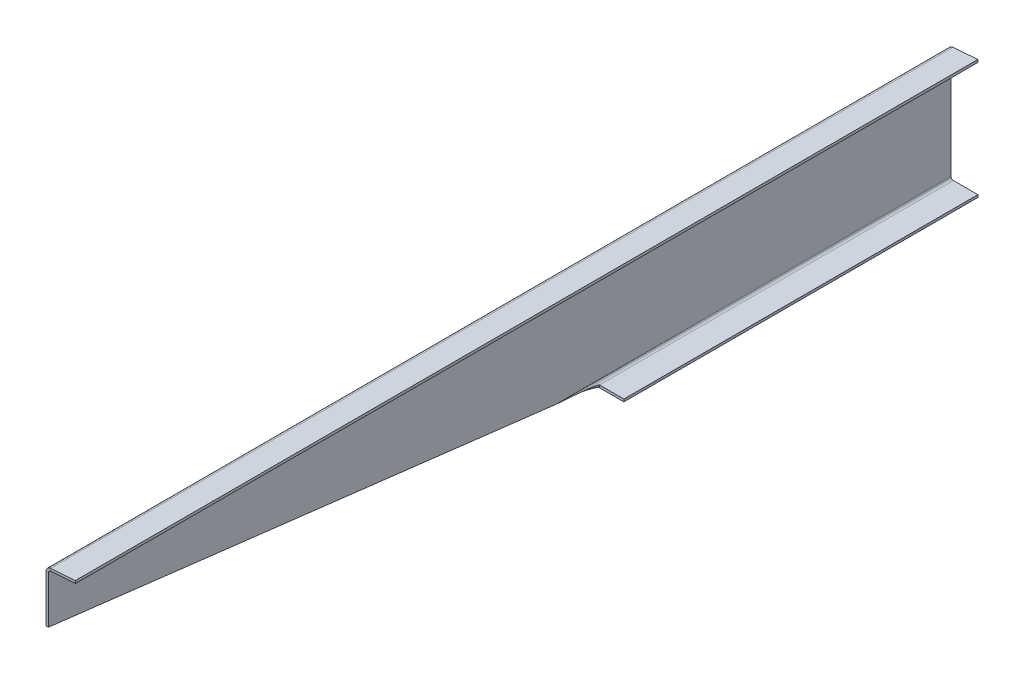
ISO-10303-21;
HEADER;
FILE_DESCRIPTION(('STEP AP214'),'2;1');
FILE_NAME('part.step','',(''),(''),'','','');
FILE_SCHEMA(('AUTOMOTIVE_DESIGN { 1 0 10303 214 1 1 1 1 }'));
ENDSEC;
DATA;
#1=APPLICATION_CONTEXT('core data for automotive mechanical design processes');
#2=APPLICATION_PROTOCOL_DEFINITION('international standard','automotive_design',2000,#1);
#3=PRODUCT_CONTEXT('',#1,'mechanical');
#4=PRODUCT('Part','Part','',(#3));
#5=PRODUCT_RELATED_PRODUCT_CATEGORY('part','',(#4));
#6=PRODUCT_DEFINITION_FORMATION('','',#4);
#7=PRODUCT_DEFINITION_CONTEXT('part definition',#1,'design');
#8=PRODUCT_DEFINITION('design','',#6,#7);
#9=PRODUCT_DEFINITION_SHAPE('','',#8);
#10=(LENGTH_UNIT() NAMED_UNIT(*) SI_UNIT(.MILLI.,.METRE.));
#11=(NAMED_UNIT(*) PLANE_ANGLE_UNIT() SI_UNIT($,.RADIAN.));
#12=(NAMED_UNIT(*) SI_UNIT($,.STERADIAN.) SOLID_ANGLE_UNIT());
#13=UNCERTAINTY_MEASURE_WITH_UNIT(LENGTH_MEASURE(1.E-05),#10,'distance_accuracy_value','');
#14=(GEOMETRIC_REPRESENTATION_CONTEXT(3) GLOBAL_UNCERTAINTY_ASSIGNED_CONTEXT((#13)) GLOBAL_UNIT_ASSIGNED_CONTEXT((#10,
#11,#12)) REPRESENTATION_CONTEXT('',''));
#15=CARTESIAN_POINT('',(0.,0.,0.));
#16=DIRECTION('',(0.,0.,1.));
#17=DIRECTION('',(1.,0.,0.));
#18=AXIS2_PLACEMENT_3D('',#15,#16,#17);
#19=CARTESIAN_POINT('',(12.7000000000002,6.35000000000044,2343.15));
#20=DIRECTION('',(0.,0.,1.));
#21=DIRECTION('',(1.,0.,0.));
#22=AXIS2_PLACEMENT_3D('',#19,#20,#21);
#23=PLANE('',#22);
#24=DIRECTION('',(0.,1.,0.));
#25=VECTOR('',#24,1.);
#26=CARTESIAN_POINT('',(0.,0.,2343.15));
#27=LINE('',#26,#25);
#28=CARTESIAN_POINT('',(0.,170.415443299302,2343.15));
#29=VERTEX_POINT('',#28);
#30=CARTESIAN_POINT('',(0.,292.957058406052,2343.15));
#31=VERTEX_POINT('',#30);
#32=EDGE_CURVE('E128',#29,#31,#27,.T.);
#33=ORIENTED_EDGE('',*,*,#32,.F.);
#34=DIRECTION('',(-1.,0.,0.));
#35=VECTOR('',#34,1.);
#36=CARTESIAN_POINT('',(0.,170.415443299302,2343.15));
#37=LINE('',#36,#35);
#38=CARTESIAN_POINT('',(6.35,170.415443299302,2343.15));
#39=VERTEX_POINT('',#38);
#40=EDGE_CURVE('E366',#29,#39,#37,.F.);
#41=ORIENTED_EDGE('',*,*,#40,.T.);
#42=DIRECTION('',(0.,1.,0.));
#43=VECTOR('',#42,1.);
#44=CARTESIAN_POINT('',(6.35,0.,2343.15));
#45=LINE('',#44,#43);
#46=CARTESIAN_POINT('',(6.35,292.957058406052,2343.15));
#47=VERTEX_POINT('',#46);
#48=EDGE_CURVE('E139',#39,#47,#45,.T.);
#49=ORIENTED_EDGE('',*,*,#48,.T.);
#50=DIRECTION('',(-1.,0.,0.));
#51=VECTOR('',#50,1.);
#52=CARTESIAN_POINT('',(6.35,292.957058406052,2343.15));
#53=LINE('',#52,#51);
#54=EDGE_CURVE('E48',#47,#31,#53,.T.);
#55=ORIENTED_EDGE('',*,*,#54,.T.);
#56=EDGE_LOOP('',(#33,#41,#49,#55));
#57=FACE_BOUND('',#56,.T.);
#58=ADVANCED_FACE('F40',(#57),#23,.T.);
#59=CARTESIAN_POINT('',(0.,0.,2343.15));
#60=DIRECTION('',(-1.,0.,0.));
#61=DIRECTION('',(0.,0.,1.));
#62=AXIS2_PLACEMENT_3D('',#59,#60,#61);
#63=PLANE('',#62);
#64=DIRECTION('',(0.,0.,-1.));
#65=VECTOR('',#64,1.);
#66=CARTESIAN_POINT('',(0.,12.7000000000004,2343.15));
#67=LINE('',#66,#65);
#68=CARTESIAN_POINT('',(0.,12.7000000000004,1025.20433517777));
#69=VERTEX_POINT('',#68);
#70=CARTESIAN_POINT('',(0.,12.7000000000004,0.));
#71=VERTEX_POINT('',#70);
#72=EDGE_CURVE('E155',#69,#71,#67,.T.);
#73=ORIENTED_EDGE('',*,*,#72,.F.);
#74=DIRECTION('',(0.,0.118819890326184,0.992915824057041));
#75=VECTOR('',#74,1.);
#76=CARTESIAN_POINT('',(0.,170.415443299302,2343.15));
#77=LINE('',#76,#75);
#78=EDGE_CURVE('E136',#69,#29,#77,.T.);
#79=ORIENTED_EDGE('',*,*,#78,.T.);
#80=ORIENTED_EDGE('',*,*,#32,.T.);
#81=DIRECTION('',(0.,0.,-1.));
#82=VECTOR('',#81,1.);
#83=CARTESIAN_POINT('',(0.,292.957058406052,2343.15));
#84=LINE('',#83,#82);
#85=CARTESIAN_POINT('',(0.,292.957058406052,0.));
#86=VERTEX_POINT('',#85);
#87=EDGE_CURVE('E134',#31,#86,#84,.T.);
#88=ORIENTED_EDGE('',*,*,#87,.T.);
#89=DIRECTION('',(0.,1.,0.));
#90=VECTOR('',#89,1.);
#91=CARTESIAN_POINT('',(0.,0.,0.));
#92=LINE('',#91,#90);
#93=EDGE_CURVE('E179',#71,#86,#92,.T.);
#94=ORIENTED_EDGE('',*,*,#93,.F.);
#95=EDGE_LOOP('',(#73,#79,#80,#88,#94));
#96=FACE_BOUND('',#95,.T.);
#97=ADVANCED_FACE('F131',(#96),#63,.T.);
#98=CARTESIAN_POINT('',(12.7,12.7000000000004,2343.15));
#99=DIRECTION('',(0.,0.,-1.));
#100=DIRECTION('',(-1.,0.,0.));
#101=AXIS2_PLACEMENT_3D('',#98,#99,#100);
#102=CYLINDRICAL_SURFACE('',#101,12.7);
#103=DIRECTION('',(0.,0.,-1.));
#104=VECTOR('',#103,1.);
#105=CARTESIAN_POINT('',(12.7000000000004,4.44089209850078E-13,2343.15));
#106=LINE('',#105,#104);
#107=CARTESIAN_POINT('',(12.7000000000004,2.72004641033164E-12,919.077061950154));
#108=VERTEX_POINT('',#107);
#109=CARTESIAN_POINT('',(12.7000000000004,4.44089209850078E-13,0.));
#110=VERTEX_POINT('',#109);
#111=EDGE_CURVE('E214',#108,#110,#106,.T.);
#112=ORIENTED_EDGE('',*,*,#111,.F.);
#113=CARTESIAN_POINT('',(12.7,12.7000000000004,1025.20433517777));
#114=DIRECTION('',(0.,0.992915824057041,-0.118819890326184));
#115=DIRECTION('',(0.,-0.118819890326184,-0.992915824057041));
#116=AXIS2_PLACEMENT_3D('',#113,#114,#115);
#117=ELLIPSE('',#116,106.884461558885,12.7);
#118=EDGE_CURVE('E330',#69,#108,#117,.F.);
#119=ORIENTED_EDGE('',*,*,#118,.F.);
#120=ORIENTED_EDGE('',*,*,#72,.T.);
#121=CARTESIAN_POINT('',(12.7,12.7000000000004,0.));
#122=DIRECTION('',(0.,0.,-1.));
#123=DIRECTION('',(-1.,0.,0.));
#124=AXIS2_PLACEMENT_3D('',#121,#122,#123);
#125=CIRCLE('',#124,12.7);
#126=EDGE_CURVE('E181',#110,#71,#125,.T.);
#127=ORIENTED_EDGE('',*,*,#126,.F.);
#128=EDGE_LOOP('',(#112,#119,#120,#127));
#129=FACE_BOUND('',#128,.T.);
#130=ADVANCED_FACE('F256',(#129),#102,.T.);
#131=CARTESIAN_POINT('',(76.2,2.66453525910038E-12,2343.15));
#132=DIRECTION('',(0.,-1.,0.));
#133=DIRECTION('',(1.,0.,0.));
#134=AXIS2_PLACEMENT_3D('',#131,#132,#133);
#135=PLANE('',#134);
#136=DIRECTION('',(0.,0.,-1.));
#137=VECTOR('',#136,1.);
#138=CARTESIAN_POINT('',(76.2,2.66453525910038E-12,2343.15));
#139=LINE('',#138,#137);
#140=CARTESIAN_POINT('',(76.2,2.72004641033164E-12,919.077061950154));
#141=VERTEX_POINT('',#140);
#142=CARTESIAN_POINT('',(76.2,2.66453525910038E-12,0.));
#143=VERTEX_POINT('',#142);
#144=EDGE_CURVE('E212',#141,#143,#139,.T.);
#145=ORIENTED_EDGE('',*,*,#144,.F.);
#146=DIRECTION('',(1.,0.,0.));
#147=VECTOR('',#146,1.);
#148=CARTESIAN_POINT('',(0.,2.72004641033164E-12,919.077061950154));
#149=LINE('',#148,#147);
#150=EDGE_CURVE('E345',#108,#141,#149,.T.);
#151=ORIENTED_EDGE('',*,*,#150,.F.);
#152=ORIENTED_EDGE('',*,*,#111,.T.);
#153=DIRECTION('',(-1.,0.,0.));
#154=VECTOR('',#153,1.);
#155=CARTESIAN_POINT('',(76.2,2.66453525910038E-12,0.));
#156=LINE('',#155,#154);
#157=EDGE_CURVE('E184',#143,#110,#156,.T.);
#158=ORIENTED_EDGE('',*,*,#157,.F.);
#159=EDGE_LOOP('',(#145,#151,#152,#158));
#160=FACE_BOUND('',#159,.T.);
#161=ADVANCED_FACE('F282',(#160),#135,.T.);
#162=CARTESIAN_POINT('',(76.1999999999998,6.35000000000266,2343.15));
#163=DIRECTION('',(1.,0.,0.));
#164=DIRECTION('',(0.,1.,0.));
#165=AXIS2_PLACEMENT_3D('',#162,#163,#164);
#166=PLANE('',#165);
#167=DIRECTION('',(0.,0.,-1.));
#168=VECTOR('',#167,1.);
#169=CARTESIAN_POINT('',(76.1999999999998,6.35000000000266,2343.15));
#170=LINE('',#169,#168);
#171=CARTESIAN_POINT('',(76.1999999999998,6.35000000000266,919.077061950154));
#172=VERTEX_POINT('',#171);
#173=CARTESIAN_POINT('',(76.1999999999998,6.35000000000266,0.));
#174=VERTEX_POINT('',#173);
#175=EDGE_CURVE('E210',#172,#174,#170,.T.);
#176=ORIENTED_EDGE('',*,*,#175,.F.);
#177=DIRECTION('',(0.,-1.,0.));
#178=VECTOR('',#177,1.);
#179=CARTESIAN_POINT('',(76.2,2.72004641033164E-12,919.077061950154));
#180=LINE('',#179,#178);
#181=EDGE_CURVE('E349',#141,#172,#180,.F.);
#182=ORIENTED_EDGE('',*,*,#181,.F.);
#183=ORIENTED_EDGE('',*,*,#144,.T.);
#184=DIRECTION('',(0.,-1.,0.));
#185=VECTOR('',#184,1.);
#186=CARTESIAN_POINT('',(76.1999999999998,6.35000000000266,0.));
#187=LINE('',#186,#185);
#188=EDGE_CURVE('E187',#174,#143,#187,.T.);
#189=ORIENTED_EDGE('',*,*,#188,.F.);
#190=EDGE_LOOP('',(#176,#182,#183,#189));
#191=FACE_BOUND('',#190,.T.);
#192=ADVANCED_FACE('F286',(#191),#166,.T.);
#193=CARTESIAN_POINT('',(76.1999999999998,6.35000000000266,2343.15));
#194=DIRECTION('',(0.,-1.,0.));
#195=DIRECTION('',(1.,0.,0.));
#196=AXIS2_PLACEMENT_3D('',#193,#194,#195);
#197=PLANE('',#196);
#198=DIRECTION('',(1.,0.,0.));
#199=VECTOR('',#198,1.);
#200=CARTESIAN_POINT('',(76.1999999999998,6.35000000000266,919.077061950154));
#201=LINE('',#200,#199);
#202=CARTESIAN_POINT('',(12.7000000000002,6.35000000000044,919.077061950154));
#203=VERTEX_POINT('',#202);
#204=EDGE_CURVE('E348',#203,#172,#201,.T.);
#205=ORIENTED_EDGE('',*,*,#204,.T.);
#206=ORIENTED_EDGE('',*,*,#175,.T.);
#207=DIRECTION('',(-1.,0.,0.));
#208=VECTOR('',#207,1.);
#209=CARTESIAN_POINT('',(76.1999999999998,6.35000000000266,0.));
#210=LINE('',#209,#208);
#211=CARTESIAN_POINT('',(12.7000000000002,6.35000000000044,0.));
#212=VERTEX_POINT('',#211);
#213=EDGE_CURVE('E190',#174,#212,#210,.T.);
#214=ORIENTED_EDGE('',*,*,#213,.T.);
#215=DIRECTION('',(0.,0.,-1.));
#216=VECTOR('',#215,1.);
#217=CARTESIAN_POINT('',(12.7000000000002,6.35000000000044,2343.15));
#218=LINE('',#217,#216);
#219=EDGE_CURVE('E208',#203,#212,#218,.T.);
#220=ORIENTED_EDGE('',*,*,#219,.F.);
#221=EDGE_LOOP('',(#205,#206,#214,#220));
#222=FACE_BOUND('',#221,.T.);
#223=ADVANCED_FACE('F290',(#222),#197,.F.);
#224=CARTESIAN_POINT('',(12.7,12.7000000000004,2343.15));
#225=DIRECTION('',(0.,0.,-1.));
#226=DIRECTION('',(-1.,0.,0.));
#227=AXIS2_PLACEMENT_3D('',#224,#225,#226);
#228=CYLINDRICAL_SURFACE('',#227,6.35);
#229=CARTESIAN_POINT('',(12.7,12.7000000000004,1025.20433517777));
#230=DIRECTION('',(0.,0.99821474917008,-0.059727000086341));
#231=DIRECTION('',(0.,-0.059727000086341,-0.99821474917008));
#232=AXIS2_PLACEMENT_3D('',#229,#230,#231);
#233=ELLIPSE('',#232,106.317075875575,6.35);
#234=CARTESIAN_POINT('',(6.35,12.7000000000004,1025.20433517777));
#235=VERTEX_POINT('',#234);
#236=EDGE_CURVE('E339',#235,#203,#233,.F.);
#237=ORIENTED_EDGE('',*,*,#236,.T.);
#238=ORIENTED_EDGE('',*,*,#219,.T.);
#239=CARTESIAN_POINT('',(12.7,12.7000000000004,0.));
#240=DIRECTION('',(0.,0.,1.));
#241=DIRECTION('',(1.,0.,0.));
#242=AXIS2_PLACEMENT_3D('',#239,#240,#241);
#243=CIRCLE('',#242,6.35);
#244=CARTESIAN_POINT('',(6.35,12.7000000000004,0.));
#245=VERTEX_POINT('',#244);
#246=EDGE_CURVE('E193',#212,#245,#243,.F.);
#247=ORIENTED_EDGE('',*,*,#246,.T.);
#248=DIRECTION('',(0.,0.,-1.));
#249=VECTOR('',#248,1.);
#250=CARTESIAN_POINT('',(6.35,12.7000000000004,2343.15));
#251=LINE('',#250,#249);
#252=EDGE_CURVE('E206',#235,#245,#251,.T.);
#253=ORIENTED_EDGE('',*,*,#252,.F.);
#254=EDGE_LOOP('',(#237,#238,#247,#253));
#255=FACE_BOUND('',#254,.T.);
#256=ADVANCED_FACE('F294',(#255),#228,.F.);
#257=CARTESIAN_POINT('',(6.35,0.,2343.15));
#258=DIRECTION('',(-1.,0.,0.));
#259=DIRECTION('',(0.,0.,1.));
#260=AXIS2_PLACEMENT_3D('',#257,#258,#259);
#261=PLANE('',#260);
#262=DIRECTION('',(0.,0.118819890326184,0.992915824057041));
#263=VECTOR('',#262,1.);
#264=CARTESIAN_POINT('',(6.35,170.415443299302,2343.15));
#265=LINE('',#264,#263);
#266=EDGE_CURVE('E362',#235,#39,#265,.T.);
#267=ORIENTED_EDGE('',*,*,#266,.F.);
#268=ORIENTED_EDGE('',*,*,#252,.T.);
#269=DIRECTION('',(0.,1.,0.));
#270=VECTOR('',#269,1.);
#271=CARTESIAN_POINT('',(6.35,0.,0.));
#272=LINE('',#271,#270);
#273=CARTESIAN_POINT('',(6.35,292.957058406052,0.));
#274=VERTEX_POINT('',#273);
#275=EDGE_CURVE('E196',#245,#274,#272,.T.);
#276=ORIENTED_EDGE('',*,*,#275,.T.);
#277=DIRECTION('',(0.,0.,-1.));
#278=VECTOR('',#277,1.);
#279=CARTESIAN_POINT('',(6.35,292.957058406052,2343.15));
#280=LINE('',#279,#278);
#281=EDGE_CURVE('E203',#47,#274,#280,.T.);
#282=ORIENTED_EDGE('',*,*,#281,.F.);
#283=ORIENTED_EDGE('',*,*,#48,.F.);
#284=EDGE_LOOP('',(#267,#268,#276,#282,#283));
#285=FACE_BOUND('',#284,.T.);
#286=ADVANCED_FACE('F234',(#285),#261,.F.);
#287=CARTESIAN_POINT('',(11.8140927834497,305.626121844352,2343.15));
#288=DIRECTION('',(0.,0.,1.));
#289=DIRECTION('',(1.,0.,0.));
#290=AXIS2_PLACEMENT_3D('',#287,#288,#289);
#291=PLANE('',#290);
#292=DIRECTION('',(0.0697564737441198,-0.997564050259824,0.));
#293=VECTOR('',#292,1.);
#294=CARTESIAN_POINT('',(11.8140927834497,305.626121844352,2343.15));
#295=LINE('',#294,#293);
#296=CARTESIAN_POINT('',(11.8140927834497,305.626121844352,2343.15));
#297=VERTEX_POINT('',#296);
#298=CARTESIAN_POINT('',(12.2570463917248,299.291590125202,2343.15));
#299=VERTEX_POINT('',#298);
#300=EDGE_CURVE('E11',#297,#299,#295,.T.);
#301=ORIENTED_EDGE('',*,*,#300,.F.);
#302=CARTESIAN_POINT('',(12.7,292.957058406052,2343.15));
#303=DIRECTION('',(0.,0.,-1.));
#304=DIRECTION('',(-1.,0.,0.));
#305=AXIS2_PLACEMENT_3D('',#302,#303,#304);
#306=CIRCLE('',#305,12.7);
#307=EDGE_CURVE('E140',#31,#297,#306,.T.);
#308=ORIENTED_EDGE('',*,*,#307,.F.);
#309=ORIENTED_EDGE('',*,*,#54,.F.);
#310=CARTESIAN_POINT('',(12.7,292.957058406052,2343.15));
#311=DIRECTION('',(0.,0.,1.));
#312=DIRECTION('',(1.,0.,0.));
#313=AXIS2_PLACEMENT_3D('',#310,#311,#312);
#314=CIRCLE('',#313,6.35);
#315=EDGE_CURVE('E166',#47,#299,#314,.F.);
#316=ORIENTED_EDGE('',*,*,#315,.T.);
#317=EDGE_LOOP('',(#301,#308,#309,#316));
#318=FACE_BOUND('',#317,.T.);
#319=ADVANCED_FACE('F42',(#318),#291,.T.);
#320=CARTESIAN_POINT('',(6.35,292.957058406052,2343.15));
#321=DIRECTION('',(0.,0.,1.));
#322=DIRECTION('',(1.,0.,0.));
#323=AXIS2_PLACEMENT_3D('',#320,#321,#322);
#324=PLANE('',#323);
#325=DIRECTION('',(0.997564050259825,0.06975647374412,0.));
#326=VECTOR('',#325,1.);
#327=CARTESIAN_POINT('',(0.,304.8,2343.15));
#328=LINE('',#327,#326);
#329=CARTESIAN_POINT('',(76.0143806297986,310.115443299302,2343.15));
#330=VERTEX_POINT('',#329);
#331=EDGE_CURVE('E158',#297,#330,#328,.T.);
#332=ORIENTED_EDGE('',*,*,#331,.F.);
#333=ORIENTED_EDGE('',*,*,#300,.T.);
#334=DIRECTION('',(0.997564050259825,0.0697564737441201,0.));
#335=VECTOR('',#334,1.);
#336=CARTESIAN_POINT('',(0.442953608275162,298.46546828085,2343.15));
#337=LINE('',#336,#335);
#338=CARTESIAN_POINT('',(76.4573342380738,303.780911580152,2343.15));
#339=VERTEX_POINT('',#338);
#340=EDGE_CURVE('E114',#299,#339,#337,.T.);
#341=ORIENTED_EDGE('',*,*,#340,.T.);
#342=DIRECTION('',(0.0697564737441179,-0.997564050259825,0.));
#343=VECTOR('',#342,1.);
#344=CARTESIAN_POINT('',(76.0143806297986,310.115443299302,2343.15));
#345=LINE('',#344,#343);
#346=EDGE_CURVE('E161',#330,#339,#345,.T.);
#347=ORIENTED_EDGE('',*,*,#346,.F.);
#348=EDGE_LOOP('',(#332,#333,#341,#347));
#349=FACE_BOUND('',#348,.T.);
#350=ADVANCED_FACE('F243',(#349),#324,.T.);
#351=CARTESIAN_POINT('',(0.,292.957058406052,0.));
#352=DIRECTION('',(0.,0.,-1.));
#353=DIRECTION('',(-1.,0.,0.));
#354=AXIS2_PLACEMENT_3D('',#351,#352,#353);
#355=PLANE('',#354);
#356=DIRECTION('',(1.,0.,0.));
#357=VECTOR('',#356,1.);
#358=CARTESIAN_POINT('',(0.,292.957058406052,0.));
#359=LINE('',#358,#357);
#360=EDGE_CURVE('E147',#86,#274,#359,.T.);
#361=ORIENTED_EDGE('',*,*,#360,.F.);
#362=CARTESIAN_POINT('',(12.7,292.957058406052,0.));
#363=DIRECTION('',(0.,0.,-1.));
#364=DIRECTION('',(-1.,0.,0.));
#365=AXIS2_PLACEMENT_3D('',#362,#363,#364);
#366=CIRCLE('',#365,12.7);
#367=CARTESIAN_POINT('',(11.8140927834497,305.626121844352,0.));
#368=VERTEX_POINT('',#367);
#369=EDGE_CURVE('E152',#86,#368,#366,.T.);
#370=ORIENTED_EDGE('',*,*,#369,.T.);
#371=DIRECTION('',(-0.0697564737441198,0.997564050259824,0.));
#372=VECTOR('',#371,1.);
#373=CARTESIAN_POINT('',(12.2570463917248,299.291590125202,0.));
#374=LINE('',#373,#372);
#375=CARTESIAN_POINT('',(12.2570463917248,299.291590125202,0.));
#376=VERTEX_POINT('',#375);
#377=EDGE_CURVE('E108',#376,#368,#374,.T.);
#378=ORIENTED_EDGE('',*,*,#377,.F.);
#379=CARTESIAN_POINT('',(12.7,292.957058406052,0.));
#380=DIRECTION('',(0.,0.,1.));
#381=DIRECTION('',(1.,0.,0.));
#382=AXIS2_PLACEMENT_3D('',#379,#380,#381);
#383=CIRCLE('',#382,6.35);
#384=EDGE_CURVE('E199',#274,#376,#383,.F.);
#385=ORIENTED_EDGE('',*,*,#384,.F.);
#386=EDGE_LOOP('',(#361,#370,#378,#385));
#387=FACE_BOUND('',#386,.T.);
#388=ADVANCED_FACE('F241',(#387),#355,.T.);
#389=CARTESIAN_POINT('',(12.2570463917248,299.291590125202,0.));
#390=DIRECTION('',(0.,0.,-1.));
#391=DIRECTION('',(-1.,0.,0.));
#392=AXIS2_PLACEMENT_3D('',#389,#390,#391);
#393=PLANE('',#392);
#394=ORIENTED_EDGE('',*,*,#93,.T.);
#395=ORIENTED_EDGE('',*,*,#360,.T.);
#396=ORIENTED_EDGE('',*,*,#275,.F.);
#397=DIRECTION('',(-1.,0.,0.));
#398=VECTOR('',#397,1.);
#399=CARTESIAN_POINT('',(6.35,12.7000000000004,0.));
#400=LINE('',#399,#398);
#401=EDGE_CURVE('E222',#245,#71,#400,.T.);
#402=ORIENTED_EDGE('',*,*,#401,.T.);
#403=EDGE_LOOP('',(#394,#395,#396,#402));
#404=FACE_BOUND('',#403,.T.);
#405=ADVANCED_FACE('F231',(#404),#393,.T.);
#406=CARTESIAN_POINT('',(12.7000000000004,4.44089209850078E-13,0.));
#407=DIRECTION('',(0.,0.,-1.));
#408=DIRECTION('',(-1.,0.,0.));
#409=AXIS2_PLACEMENT_3D('',#406,#407,#408);
#410=PLANE('',#409);
#411=DIRECTION('',(0.,1.,0.));
#412=VECTOR('',#411,1.);
#413=CARTESIAN_POINT('',(12.7000000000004,4.44089209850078E-13,0.));
#414=LINE('',#413,#412);
#415=EDGE_CURVE('E225',#110,#212,#414,.T.);
#416=ORIENTED_EDGE('',*,*,#415,.F.);
#417=ORIENTED_EDGE('',*,*,#126,.T.);
#418=ORIENTED_EDGE('',*,*,#401,.F.);
#419=ORIENTED_EDGE('',*,*,#246,.F.);
#420=EDGE_LOOP('',(#416,#417,#418,#419));
#421=FACE_BOUND('',#420,.T.);
#422=ADVANCED_FACE('F249',(#421),#410,.T.);
#423=CARTESIAN_POINT('',(6.35,12.7000000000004,0.));
#424=DIRECTION('',(0.,0.,-1.));
#425=DIRECTION('',(-1.,0.,0.));
#426=AXIS2_PLACEMENT_3D('',#423,#424,#425);
#427=PLANE('',#426);
#428=ORIENTED_EDGE('',*,*,#157,.T.);
#429=ORIENTED_EDGE('',*,*,#415,.T.);
#430=ORIENTED_EDGE('',*,*,#213,.F.);
#431=ORIENTED_EDGE('',*,*,#188,.T.);
#432=EDGE_LOOP('',(#428,#429,#430,#431));
#433=FACE_BOUND('',#432,.T.);
#434=ADVANCED_FACE('F261',(#433),#427,.T.);
#435=CARTESIAN_POINT('',(0.442953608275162,298.46546828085,2343.15));
#436=DIRECTION('',(-0.0697564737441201,0.997564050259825,0.));
#437=DIRECTION('',(-0.997564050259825,-0.0697564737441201,0.));
#438=AXIS2_PLACEMENT_3D('',#435,#436,#437);
#439=PLANE('',#438);
#440=DIRECTION('',(0.997564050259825,0.0697564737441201,0.));
#441=VECTOR('',#440,1.);
#442=CARTESIAN_POINT('',(0.442953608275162,298.46546828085,0.));
#443=LINE('',#442,#441);
#444=CARTESIAN_POINT('',(76.4573342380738,303.780911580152,0.));
#445=VERTEX_POINT('',#444);
#446=EDGE_CURVE('E169',#376,#445,#443,.T.);
#447=ORIENTED_EDGE('',*,*,#446,.T.);
#448=DIRECTION('',(0.,0.,-1.));
#449=VECTOR('',#448,1.);
#450=CARTESIAN_POINT('',(76.4573342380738,303.780911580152,2343.15));
#451=LINE('',#450,#449);
#452=EDGE_CURVE('E220',#339,#445,#451,.T.);
#453=ORIENTED_EDGE('',*,*,#452,.F.);
#454=ORIENTED_EDGE('',*,*,#340,.F.);
#455=DIRECTION('',(0.,0.,-1.));
#456=VECTOR('',#455,1.);
#457=CARTESIAN_POINT('',(12.2570463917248,299.291590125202,2343.15));
#458=LINE('',#457,#456);
#459=EDGE_CURVE('E168',#299,#376,#458,.T.);
#460=ORIENTED_EDGE('',*,*,#459,.T.);
#461=EDGE_LOOP('',(#447,#453,#454,#460));
#462=FACE_BOUND('',#461,.T.);
#463=ADVANCED_FACE('F265',(#462),#439,.F.);
#464=CARTESIAN_POINT('',(76.0143806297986,310.115443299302,2343.15));
#465=DIRECTION('',(0.997564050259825,0.0697564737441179,0.));
#466=DIRECTION('',(-0.0697564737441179,0.997564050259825,0.));
#467=AXIS2_PLACEMENT_3D('',#464,#465,#466);
#468=PLANE('',#467);
#469=DIRECTION('',(0.0697564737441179,-0.997564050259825,0.));
#470=VECTOR('',#469,1.);
#471=CARTESIAN_POINT('',(76.0143806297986,310.115443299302,0.));
#472=LINE('',#471,#470);
#473=CARTESIAN_POINT('',(76.0143806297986,310.115443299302,0.));
#474=VERTEX_POINT('',#473);
#475=EDGE_CURVE('E172',#474,#445,#472,.T.);
#476=ORIENTED_EDGE('',*,*,#475,.F.);
#477=DIRECTION('',(0.,0.,-1.));
#478=VECTOR('',#477,1.);
#479=CARTESIAN_POINT('',(76.0143806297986,310.115443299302,2343.15));
#480=LINE('',#479,#478);
#481=EDGE_CURVE('E218',#330,#474,#480,.T.);
#482=ORIENTED_EDGE('',*,*,#481,.F.);
#483=ORIENTED_EDGE('',*,*,#346,.T.);
#484=ORIENTED_EDGE('',*,*,#452,.T.);
#485=EDGE_LOOP('',(#476,#482,#483,#484));
#486=FACE_BOUND('',#485,.T.);
#487=ADVANCED_FACE('F269',(#486),#468,.T.);
#488=CARTESIAN_POINT('',(0.,304.8,2343.15));
#489=DIRECTION('',(-0.0697564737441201,0.997564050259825,0.));
#490=DIRECTION('',(-0.997564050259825,-0.0697564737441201,0.));
#491=AXIS2_PLACEMENT_3D('',#488,#489,#490);
#492=PLANE('',#491);
#493=DIRECTION('',(0.997564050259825,0.06975647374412,0.));
#494=VECTOR('',#493,1.);
#495=CARTESIAN_POINT('',(0.,304.8,0.));
#496=LINE('',#495,#494);
#497=EDGE_CURVE('E175',#368,#474,#496,.T.);
#498=ORIENTED_EDGE('',*,*,#497,.F.);
#499=DIRECTION('',(0.,0.,-1.));
#500=VECTOR('',#499,1.);
#501=CARTESIAN_POINT('',(11.8140927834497,305.626121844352,2343.15));
#502=LINE('',#501,#500);
#503=EDGE_CURVE('E154',#297,#368,#502,.T.);
#504=ORIENTED_EDGE('',*,*,#503,.F.);
#505=ORIENTED_EDGE('',*,*,#331,.T.);
#506=ORIENTED_EDGE('',*,*,#481,.T.);
#507=EDGE_LOOP('',(#498,#504,#505,#506));
#508=FACE_BOUND('',#507,.T.);
#509=ADVANCED_FACE('F273',(#508),#492,.T.);
#510=CARTESIAN_POINT('',(12.7,292.957058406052,2343.15));
#511=DIRECTION('',(0.,0.,-1.));
#512=DIRECTION('',(-1.,0.,0.));
#513=AXIS2_PLACEMENT_3D('',#510,#511,#512);
#514=CYLINDRICAL_SURFACE('',#513,12.7);
#515=ORIENTED_EDGE('',*,*,#369,.F.);
#516=ORIENTED_EDGE('',*,*,#87,.F.);
#517=ORIENTED_EDGE('',*,*,#307,.T.);
#518=ORIENTED_EDGE('',*,*,#503,.T.);
#519=EDGE_LOOP('',(#515,#516,#517,#518));
#520=FACE_BOUND('',#519,.T.);
#521=ADVANCED_FACE('F150',(#520),#514,.T.);
#522=CARTESIAN_POINT('',(12.7,292.957058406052,2343.15));
#523=DIRECTION('',(0.,0.,-1.));
#524=DIRECTION('',(-1.,0.,0.));
#525=AXIS2_PLACEMENT_3D('',#522,#523,#524);
#526=CYLINDRICAL_SURFACE('',#525,6.35);
#527=ORIENTED_EDGE('',*,*,#384,.T.);
#528=ORIENTED_EDGE('',*,*,#459,.F.);
#529=ORIENTED_EDGE('',*,*,#315,.F.);
#530=ORIENTED_EDGE('',*,*,#281,.T.);
#531=EDGE_LOOP('',(#527,#528,#529,#530));
#532=FACE_BOUND('',#531,.T.);
#533=ADVANCED_FACE('F239',(#532),#526,.F.);
#534=CARTESIAN_POINT('',(12.7,292.957058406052,0.));
#535=DIRECTION('',(0.,0.,-1.));
#536=DIRECTION('',(-1.,0.,0.));
#537=AXIS2_PLACEMENT_3D('',#534,#535,#536);
#538=PLANE('',#537);
#539=ORIENTED_EDGE('',*,*,#446,.F.);
#540=ORIENTED_EDGE('',*,*,#377,.T.);
#541=ORIENTED_EDGE('',*,*,#497,.T.);
#542=ORIENTED_EDGE('',*,*,#475,.T.);
#543=EDGE_LOOP('',(#539,#540,#541,#542));
#544=FACE_BOUND('',#543,.T.);
#545=ADVANCED_FACE('F303',(#544),#538,.T.);
#546=CARTESIAN_POINT('',(0.,170.415443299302,2343.15));
#547=DIRECTION('',(0.,-0.992915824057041,0.118819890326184));
#548=DIRECTION('',(0.,0.118819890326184,0.992915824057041));
#549=AXIS2_PLACEMENT_3D('',#546,#547,#548);
#550=PLANE('',#549);
#551=ORIENTED_EDGE('',*,*,#78,.F.);
#552=DIRECTION('',(-1.,0.,0.));
#553=VECTOR('',#552,1.);
#554=CARTESIAN_POINT('',(0.,12.7000000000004,1025.20433517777));
#555=LINE('',#554,#553);
#556=EDGE_CURVE('E55',#69,#235,#555,.F.);
#557=ORIENTED_EDGE('',*,*,#556,.T.);
#558=ORIENTED_EDGE('',*,*,#266,.T.);
#559=ORIENTED_EDGE('',*,*,#40,.F.);
#560=EDGE_LOOP('',(#551,#557,#558,#559));
#561=FACE_BOUND('',#560,.T.);
#562=ADVANCED_FACE('F306',(#561),#550,.T.);
#563=CARTESIAN_POINT('',(0.,2.72004641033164E-12,919.077061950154));
#564=DIRECTION('',(0.,0.,-1.));
#565=DIRECTION('',(1.,0.,0.));
#566=AXIS2_PLACEMENT_3D('',#563,#564,#565);
#567=PLANE('',#566);
#568=ORIENTED_EDGE('',*,*,#150,.T.);
#569=ORIENTED_EDGE('',*,*,#181,.T.);
#570=ORIENTED_EDGE('',*,*,#204,.F.);
#571=DIRECTION('',(0.,-1.,0.));
#572=VECTOR('',#571,1.);
#573=CARTESIAN_POINT('',(12.7000000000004,2.72004641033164E-12,919.077061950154));
#574=LINE('',#573,#572);
#575=EDGE_CURVE('E333',#108,#203,#574,.F.);
#576=ORIENTED_EDGE('',*,*,#575,.F.);
#577=EDGE_LOOP('',(#568,#569,#570,#576));
#578=FACE_BOUND('',#577,.T.);
#579=ADVANCED_FACE('F310',(#578),#567,.F.);
#580=CARTESIAN_POINT('',(12.7,4.44089209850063E-13,919.077061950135));
#581=CARTESIAN_POINT('',(12.7,2.11666666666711,919.077061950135));
#582=CARTESIAN_POINT('',(12.7,4.23333333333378,919.077061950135));
#583=CARTESIAN_POINT('',(12.7,6.35000000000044,919.077061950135));
#584=CARTESIAN_POINT('',(38.1,4.44089209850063E-13,919.077061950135));
#585=CARTESIAN_POINT('',(33.8666666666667,2.11666666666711,919.077061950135));
#586=CARTESIAN_POINT('',(29.6333333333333,4.23333333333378,919.077061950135));
#587=CARTESIAN_POINT('',(25.4,6.35000000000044,919.077061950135));
#588=CARTESIAN_POINT('',(38.1,25.4000000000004,1131.3316084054));
#589=CARTESIAN_POINT('',(33.8666666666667,23.2833333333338,1131.3316084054));
#590=CARTESIAN_POINT('',(29.6333333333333,21.1666666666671,1131.3316084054));
#591=CARTESIAN_POINT('',(25.4,19.0500000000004,1131.3316084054));
#592=CARTESIAN_POINT('',(12.7,25.4000000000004,1131.3316084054));
#593=CARTESIAN_POINT('',(12.7,23.2833333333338,1131.3316084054));
#594=CARTESIAN_POINT('',(12.7,21.1666666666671,1131.3316084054));
#595=CARTESIAN_POINT('',(12.7,19.0500000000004,1131.3316084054));
#596=CARTESIAN_POINT('',(-12.7,25.4000000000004,1131.3316084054));
#597=CARTESIAN_POINT('',(-8.46666666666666,23.2833333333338,1131.3316084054));
#598=CARTESIAN_POINT('',(-4.23333333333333,21.1666666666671,1131.3316084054));
#599=CARTESIAN_POINT('',(0.,19.0500000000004,1131.3316084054));
#600=CARTESIAN_POINT('',(-12.7,4.44089209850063E-13,919.077061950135));
#601=CARTESIAN_POINT('',(-8.46666666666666,2.11666666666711,919.077061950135));
#602=CARTESIAN_POINT('',(-4.23333333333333,4.23333333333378,919.077061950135));
#603=CARTESIAN_POINT('',(0.,6.35000000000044,919.077061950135));
#604=CARTESIAN_POINT('',(12.7,4.44089209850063E-13,919.077061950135));
#605=CARTESIAN_POINT('',(12.7,2.11666666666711,919.077061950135));
#606=CARTESIAN_POINT('',(12.7,4.23333333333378,919.077061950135));
#607=CARTESIAN_POINT('',(12.7,6.35000000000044,919.077061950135));
#608=(BOUNDED_SURFACE() B_SPLINE_SURFACE(3,3,((#580,#581,#582,#583),(#584,#585,#586,#587),(#588,
#589,#590,#591),(#592,#593,#594,#595),(#596,#597,#598,#599),(#600,#601,#602,#603),(#604,#605,
#606,#607)),.UNSPECIFIED.,.T.,.F.,.F.) B_SPLINE_SURFACE_WITH_KNOTS((4,3,4),(4,4),(0.,0.5,1.),
(0.,1.),.UNSPECIFIED.) GEOMETRIC_REPRESENTATION_ITEM() RATIONAL_B_SPLINE_SURFACE(((1.,1.,1.,1.),
(0.333333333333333,0.333333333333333,0.333333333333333,0.333333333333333),(0.333333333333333,
0.333333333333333,0.333333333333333,0.333333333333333),(1.,1.,1.,1.),(0.333333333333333,
0.333333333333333,0.333333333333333,0.333333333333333),(0.333333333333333,0.333333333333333,
0.333333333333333,0.333333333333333),(1.,1.,1.,1.))) REPRESENTATION_ITEM('') SURFACE());
#609=ORIENTED_EDGE('',*,*,#118,.T.);
#610=ORIENTED_EDGE('',*,*,#575,.T.);
#611=ORIENTED_EDGE('',*,*,#236,.F.);
#612=ORIENTED_EDGE('',*,*,#556,.F.);
#613=EDGE_LOOP('',(#609,#610,#611,#612));
#614=FACE_BOUND('',#613,.T.);
#615=ADVANCED_FACE('F313',(#614),#608,.T.);
#616=CLOSED_SHELL('',(#58,#97,#130,#161,#192,#223,#256,#286,#319,#350,#388,#405,#422,#434,#463,
#487,#509,#521,#533,#545,#562,#579,#615));
#617=MANIFOLD_SOLID_BREP('B2',#616);
#618=ADVANCED_BREP_SHAPE_REPRESENTATION('',(#18,#617),#14);
#619=SHAPE_DEFINITION_REPRESENTATION(#9,#618);
ENDSEC;
END-ISO-10303-21;
